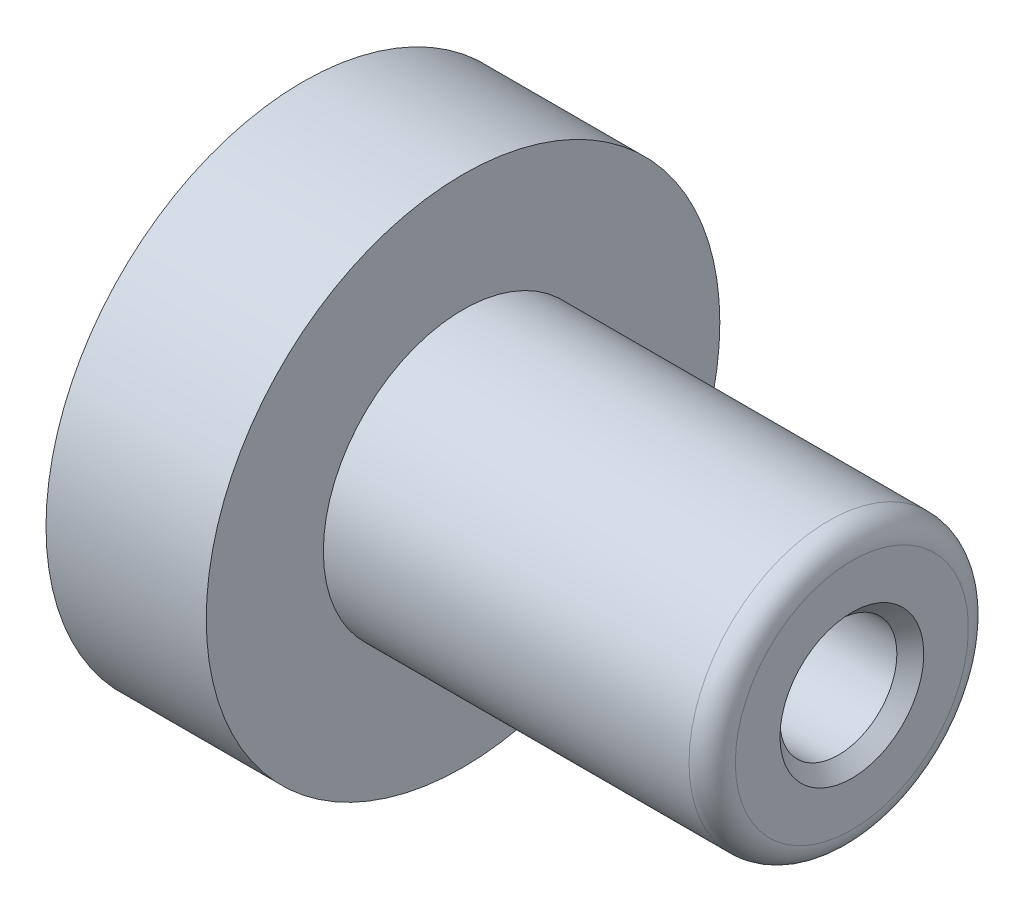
from build123d import *

# Parameters (mm, degrees)
SKETCH2_R          = 1.6129
CUT_EXTRUDE1_DEPTH = 6.35
SKETCH3_R          = 3.9751
CUT_EXTRUDE2_DEPTH = 45.766103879
CHAMFER1_SIZE      = 0.9144


with BuildPart() as part:
    # Sketch1 → Revolve1 (revolve)
    with BuildSketch(Plane.XY, mode=Mode.PRIVATE) as revolve1_sk:
        with BuildLine():
            Line((0, 6.7437), (0, 17.4625))
            Line((0, 17.4625), (10.8966, 17.4625))
            Line((10.8966, 17.4625), (10.8966, 9.4996))
            Line((10.8966, 9.4996), (35.7632, 9.4996))
            ThreePointArc((35.7632, 9.4996), (36.876751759, 9.038351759), (37.338, 7.9248))
            Line((37.338, 7.9248), (37.338, 0))
            Line((37.338, 0), (20.447, 0))
            Line((20.447, 0), (20.447, 6.7437))
            Line((20.447, 6.7437), (0, 6.7437))
        make_face()
    revolve(revolve1_sk.sketch.rotate(Axis((0, 0, 0), (1, 0, 0)), 90), axis=Axis((0, 0, 0), (1, 0, 0)))

    # Sketch2 → Cut-Extrude1 (cut)
    with BuildSketch(Plane.ZY):
        with Locations((-11.1125, 0)):
            Circle(SKETCH2_R)
        with Locations(Location((11.1125, 0, 0), (0, 0, 180))):
            Circle(SKETCH2_R)
    extrude(amount=-CUT_EXTRUDE1_DEPTH, mode=Mode.SUBTRACT)

    # Sketch3 → Cut-Extrude2 (cut, through all)
    with BuildSketch(Plane(origin=(37.338, 0, 0), x_dir=(0, 0, -1), z_dir=(1, 0, 0))):
        Circle(SKETCH3_R)
    extrude(amount=-CUT_EXTRUDE2_DEPTH, mode=Mode.SUBTRACT)

    # Chamfer1
    chamfer1_edges = [part.edges().sort_by_distance(p)[0] for p in [
        (37.338, 0, 3.9751),
    ]]
    chamfer(chamfer1_edges, length=CHAMFER1_SIZE)


solid = part.part
